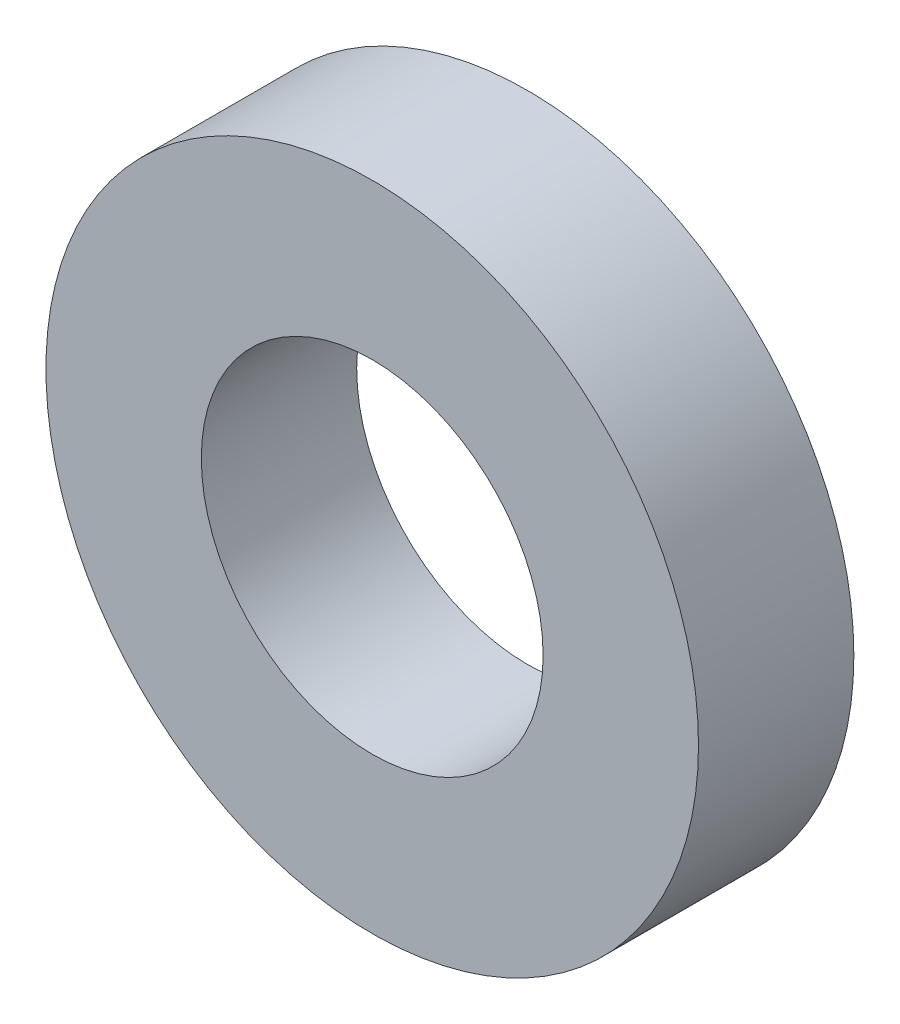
from build123d import *

# Parameters (mm, degrees)
SKETCH1_R          = 2.1
SKETCH1_R_2        = 1.1
BASE_EXTRUDE_DEPTH = 1


with BuildPart() as part:
    # Sketch1 → Base-Extrude (new body)
    with BuildSketch(Plane.XY):
        Circle(SKETCH1_R)
        Circle(SKETCH1_R_2, mode=Mode.SUBTRACT)
    extrude(amount=-BASE_EXTRUDE_DEPTH)


solid = part.part
